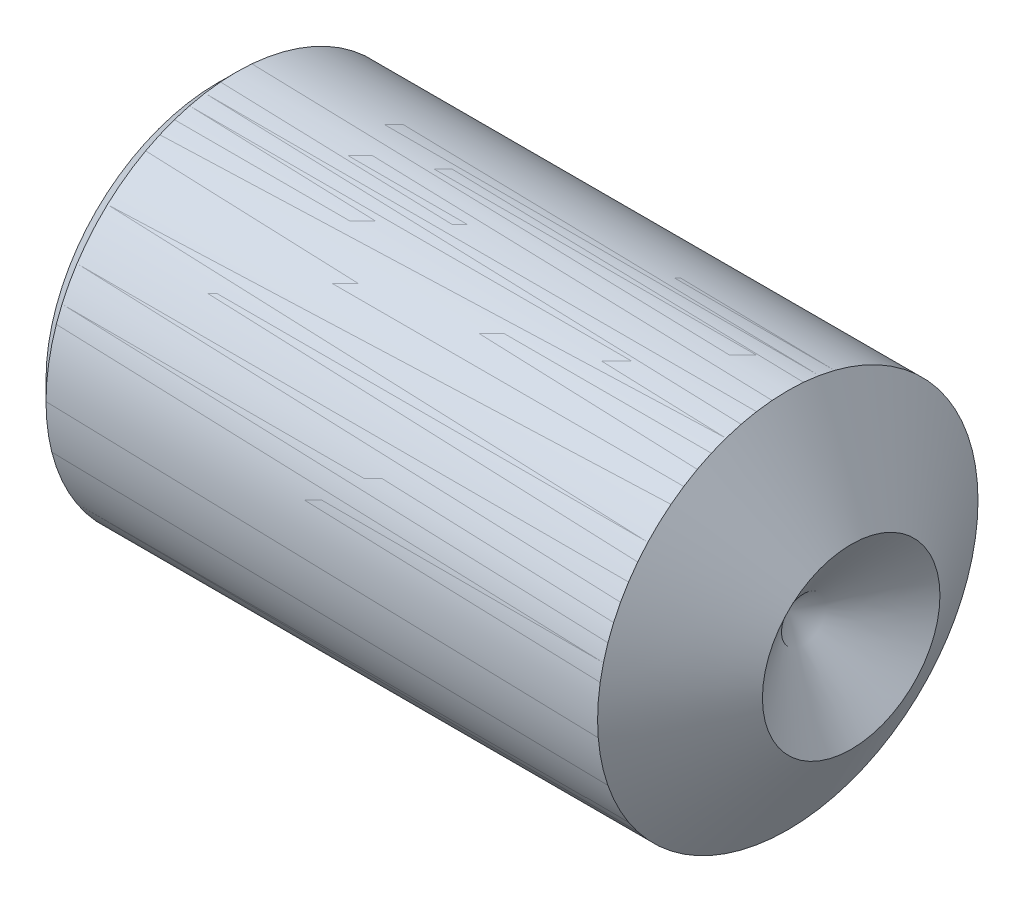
ISO-10303-21;
HEADER;
FILE_DESCRIPTION(('STEP AP214'),'2;1');
FILE_NAME('part.step','',(''),(''),'','','');
FILE_SCHEMA(('AUTOMOTIVE_DESIGN { 1 0 10303 214 1 1 1 1 }'));
ENDSEC;
DATA;
#1=APPLICATION_CONTEXT('core data for automotive mechanical design processes');
#2=APPLICATION_PROTOCOL_DEFINITION('international standard','automotive_design',2000,#1);
#3=PRODUCT_CONTEXT('',#1,'mechanical');
#4=PRODUCT('Part','Part','',(#3));
#5=PRODUCT_RELATED_PRODUCT_CATEGORY('part','',(#4));
#6=PRODUCT_DEFINITION_FORMATION('','',#4);
#7=PRODUCT_DEFINITION_CONTEXT('part definition',#1,'design');
#8=PRODUCT_DEFINITION('design','',#6,#7);
#9=PRODUCT_DEFINITION_SHAPE('','',#8);
#10=(LENGTH_UNIT() NAMED_UNIT(*) SI_UNIT(.MILLI.,.METRE.));
#11=(NAMED_UNIT(*) PLANE_ANGLE_UNIT() SI_UNIT($,.RADIAN.));
#12=(NAMED_UNIT(*) SI_UNIT($,.STERADIAN.) SOLID_ANGLE_UNIT());
#13=UNCERTAINTY_MEASURE_WITH_UNIT(LENGTH_MEASURE(1.E-05),#10,'distance_accuracy_value','');
#14=(GEOMETRIC_REPRESENTATION_CONTEXT(3) GLOBAL_UNCERTAINTY_ASSIGNED_CONTEXT((#13)) GLOBAL_UNIT_ASSIGNED_CONTEXT((#10,
#11,#12)) REPRESENTATION_CONTEXT('',''));
#15=CARTESIAN_POINT('',(0.,0.,0.));
#16=DIRECTION('',(0.,0.,1.));
#17=DIRECTION('',(1.,0.,0.));
#18=AXIS2_PLACEMENT_3D('',#15,#16,#17);
#19=CARTESIAN_POINT('',(-0.8125,0.3247595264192,-0.1875));
#20=DIRECTION('',(0.894427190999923,0.38729833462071,-0.223606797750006));
#21=DIRECTION('',(-0.397359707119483,0.91766293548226,0.));
#22=AXIS2_PLACEMENT_3D('',#19,#20,#21);
#23=PLANE('',#22);
#24=DIRECTION('',(0.397359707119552,-0.458831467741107,0.794719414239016));
#25=VECTOR('',#24,1.);
#26=CARTESIAN_POINT('',(-1.00000000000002,0.4330127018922,-0.749999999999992));
#27=LINE('',#26,#25);
#28=CARTESIAN_POINT('',(-1.,0.433012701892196,-0.749999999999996));
#29=VERTEX_POINT('',#28);
#30=CARTESIAN_POINT('',(-0.624999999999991,0.,0.));
#31=VERTEX_POINT('',#30);
#32=EDGE_CURVE('P0_E146',#29,#31,#27,.T.);
#33=ORIENTED_EDGE('',*,*,#32,.T.);
#34=DIRECTION('',(-0.397359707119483,0.91766293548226,0.));
#35=VECTOR('',#34,1.);
#36=CARTESIAN_POINT('',(-0.773026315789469,0.341852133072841,0.));
#37=LINE('',#36,#35);
#38=CARTESIAN_POINT('',(-0.999999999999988,0.866025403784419,0.));
#39=VERTEX_POINT('',#38);
#40=EDGE_CURVE('P0_E187',#31,#39,#37,.T.);
#41=ORIENTED_EDGE('',*,*,#40,.T.);
#42=DIRECTION('',(0.,0.500000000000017,0.866025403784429));
#43=VECTOR('',#42,1.);
#44=CARTESIAN_POINT('',(-1.,0.6495190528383,-0.375));
#45=LINE('',#44,#43);
#46=EDGE_CURVE('P0_E93',#39,#29,#45,.F.);
#47=ORIENTED_EDGE('',*,*,#46,.T.);
#48=EDGE_LOOP('',(#33,#41,#47));
#49=FACE_BOUND('',#48,.T.);
#50=ADVANCED_FACE('P0_F17',(#49),#23,.F.);
#51=CARTESIAN_POINT('',(-0.8125,0.,-0.375));
#52=DIRECTION('',(0.894427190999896,0.,-0.447213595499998));
#53=DIRECTION('',(-0.447213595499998,0.,-0.894427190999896));
#54=AXIS2_PLACEMENT_3D('',#51,#52,#53);
#55=PLANE('',#54);
#56=DIRECTION('',(0.397359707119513,0.458831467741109,0.794719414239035));
#57=VECTOR('',#56,1.);
#58=CARTESIAN_POINT('',(-0.99999999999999,-0.433012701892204,-0.750000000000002));
#59=LINE('',#58,#57);
#60=CARTESIAN_POINT('',(-0.999999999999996,-0.433012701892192,-0.749999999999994));
#61=VERTEX_POINT('',#60);
#62=EDGE_CURVE('P0_E148',#61,#31,#59,.T.);
#63=ORIENTED_EDGE('',*,*,#62,.T.);
#64=ORIENTED_EDGE('',*,*,#32,.F.);
#65=DIRECTION('',(0.,1.,0.));
#66=VECTOR('',#65,1.);
#67=CARTESIAN_POINT('',(-1.,0.,-0.75));
#68=LINE('',#67,#66);
#69=EDGE_CURVE('P0_E92',#29,#61,#68,.F.);
#70=ORIENTED_EDGE('',*,*,#69,.T.);
#71=EDGE_LOOP('',(#63,#64,#70));
#72=FACE_BOUND('',#71,.T.);
#73=ADVANCED_FACE('P0_F343',(#72),#55,.F.);
#74=CARTESIAN_POINT('',(-0.8125,-0.3247595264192,-0.1875));
#75=DIRECTION('',(0.894427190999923,-0.38729833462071,-0.223606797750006));
#76=DIRECTION('',(0.397359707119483,0.91766293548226,0.));
#77=AXIS2_PLACEMENT_3D('',#74,#75,#76);
#78=PLANE('',#77);
#79=DIRECTION('',(0.397359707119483,0.91766293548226,0.));
#80=VECTOR('',#79,1.);
#81=CARTESIAN_POINT('',(-0.773026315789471,-0.34185213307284,0.));
#82=LINE('',#81,#80);
#83=CARTESIAN_POINT('',(-0.99999999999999,-0.866025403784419,0.));
#84=VERTEX_POINT('',#83);
#85=EDGE_CURVE('P0_E157',#84,#31,#82,.T.);
#86=ORIENTED_EDGE('',*,*,#85,.T.);
#87=ORIENTED_EDGE('',*,*,#62,.F.);
#88=DIRECTION('',(0.,0.500000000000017,-0.866025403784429));
#89=VECTOR('',#88,1.);
#90=CARTESIAN_POINT('',(-1.,-0.6495190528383,-0.375));
#91=LINE('',#90,#89);
#92=EDGE_CURVE('P0_E160',#61,#84,#91,.F.);
#93=ORIENTED_EDGE('',*,*,#92,.T.);
#94=EDGE_LOOP('',(#86,#87,#93));
#95=FACE_BOUND('',#94,.T.);
#96=ADVANCED_FACE('P0_F335',(#95),#78,.F.);
#97=CARTESIAN_POINT('',(-0.8125,-0.3247595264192,0.1875));
#98=DIRECTION('',(0.894427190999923,-0.38729833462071,0.223606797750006));
#99=DIRECTION('',(0.397359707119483,0.91766293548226,0.));
#100=AXIS2_PLACEMENT_3D('',#97,#98,#99);
#101=PLANE('',#100);
#102=DIRECTION('',(0.397359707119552,0.458831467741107,-0.794719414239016));
#103=VECTOR('',#102,1.);
#104=CARTESIAN_POINT('',(-1.00000000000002,-0.4330127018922,0.749999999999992));
#105=LINE('',#104,#103);
#106=CARTESIAN_POINT('',(-1.,-0.433012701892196,0.749999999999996));
#107=VERTEX_POINT('',#106);
#108=EDGE_CURVE('P0_E167',#107,#31,#105,.T.);
#109=ORIENTED_EDGE('',*,*,#108,.T.);
#110=ORIENTED_EDGE('',*,*,#85,.F.);
#111=DIRECTION('',(0.,-0.500000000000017,-0.866025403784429));
#112=VECTOR('',#111,1.);
#113=CARTESIAN_POINT('',(-1.,-0.6495190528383,0.375));
#114=LINE('',#113,#112);
#115=EDGE_CURVE('P0_E170',#84,#107,#114,.F.);
#116=ORIENTED_EDGE('',*,*,#115,.T.);
#117=EDGE_LOOP('',(#109,#110,#116));
#118=FACE_BOUND('',#117,.T.);
#119=ADVANCED_FACE('P0_F327',(#118),#101,.F.);
#120=CARTESIAN_POINT('',(-0.8125,0.,0.375));
#121=DIRECTION('',(0.894427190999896,0.,0.447213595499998));
#122=DIRECTION('',(0.447213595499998,0.,-0.894427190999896));
#123=AXIS2_PLACEMENT_3D('',#120,#121,#122);
#124=PLANE('',#123);
#125=DIRECTION('',(0.397359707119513,-0.458831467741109,-0.794719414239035));
#126=VECTOR('',#125,1.);
#127=CARTESIAN_POINT('',(-0.99999999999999,0.433012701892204,0.750000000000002));
#128=LINE('',#127,#126);
#129=CARTESIAN_POINT('',(-0.999999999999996,0.433012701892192,0.749999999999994));
#130=VERTEX_POINT('',#129);
#131=EDGE_CURVE('P0_E177',#130,#31,#128,.T.);
#132=ORIENTED_EDGE('',*,*,#131,.T.);
#133=ORIENTED_EDGE('',*,*,#108,.F.);
#134=DIRECTION('',(0.,1.,0.));
#135=VECTOR('',#134,1.);
#136=CARTESIAN_POINT('',(-1.,0.,0.75));
#137=LINE('',#136,#135);
#138=EDGE_CURVE('P0_E180',#107,#130,#137,.T.);
#139=ORIENTED_EDGE('',*,*,#138,.T.);
#140=EDGE_LOOP('',(#132,#133,#139));
#141=FACE_BOUND('',#140,.T.);
#142=ADVANCED_FACE('P0_F319',(#141),#124,.F.);
#143=CARTESIAN_POINT('',(-0.8125,0.3247595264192,0.1875));
#144=DIRECTION('',(0.894427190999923,0.38729833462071,0.223606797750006));
#145=DIRECTION('',(-0.397359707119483,0.91766293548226,0.));
#146=AXIS2_PLACEMENT_3D('',#143,#144,#145);
#147=PLANE('',#146);
#148=ORIENTED_EDGE('',*,*,#40,.F.);
#149=ORIENTED_EDGE('',*,*,#131,.F.);
#150=DIRECTION('',(0.,-0.500000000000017,0.866025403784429));
#151=VECTOR('',#150,1.);
#152=CARTESIAN_POINT('',(-1.,0.6495190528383,0.375));
#153=LINE('',#152,#151);
#154=EDGE_CURVE('P0_E193',#130,#39,#153,.F.);
#155=ORIENTED_EDGE('',*,*,#154,.T.);
#156=EDGE_LOOP('',(#148,#149,#155));
#157=FACE_BOUND('',#156,.T.);
#158=ADVANCED_FACE('P0_F313',(#157),#147,.F.);
#159=CARTESIAN_POINT('',(-1.75,0.6495190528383,-0.375));
#160=DIRECTION('',(0.,0.866025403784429,-0.500000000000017));
#161=DIRECTION('',(0.,0.500000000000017,0.866025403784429));
#162=AXIS2_PLACEMENT_3D('',#159,#160,#161);
#163=PLANE('',#162);
#164=ORIENTED_EDGE('',*,*,#46,.F.);
#165=DIRECTION('',(1.,0.,0.));
#166=VECTOR('',#165,1.);
#167=CARTESIAN_POINT('',(-1.75,0.866025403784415,0.));
#168=LINE('',#167,#166);
#169=CARTESIAN_POINT('',(-2.45102540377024,0.866025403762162,0.));
#170=VERTEX_POINT('',#169);
#171=EDGE_CURVE('P0_E86',#39,#170,#168,.F.);
#172=ORIENTED_EDGE('',*,*,#171,.T.);
#173=CARTESIAN_POINT('',(-2.45102540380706,0.866025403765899,-2.2156686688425E-11));
#174=CARTESIAN_POINT('',(-2.43615687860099,0.851142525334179,-0.0257779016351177));
#175=CARTESIAN_POINT('',(-2.42216167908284,0.836010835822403,-0.0519867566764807));
#176=CARTESIAN_POINT('',(-2.39653706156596,0.805155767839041,-0.105429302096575));
#177=CARTESIAN_POINT('',(-2.38492189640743,0.789429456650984,-0.132668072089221));
#178=CARTESIAN_POINT('',(-2.3650251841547,0.757718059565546,-0.18759382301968));
#179=CARTESIAN_POINT('',(-2.35669363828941,0.741741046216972,-0.2152668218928));
#180=CARTESIAN_POINT('',(-2.34385676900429,0.709435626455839,-0.271221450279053));
#181=CARTESIAN_POINT('',(-2.33934186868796,0.693108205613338,-0.29950137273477));
#182=CARTESIAN_POINT('',(-2.3352695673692,0.664965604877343,-0.348245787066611));
#183=CARTESIAN_POINT('',(-2.33466782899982,0.653186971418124,-0.368646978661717));
#184=CARTESIAN_POINT('',(-2.33568198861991,0.629652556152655,-0.409409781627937));
#185=CARTESIAN_POINT('',(-2.337298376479,0.617896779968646,-0.429771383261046));
#186=CARTESIAN_POINT('',(-2.34536789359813,0.582797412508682,-0.490565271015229));
#187=CARTESIAN_POINT('',(-2.35504228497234,0.55962854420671,-0.530694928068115));
#188=CARTESIAN_POINT('',(-2.37837866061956,0.518981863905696,-0.601097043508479));
#189=CARTESIAN_POINT('',(-2.39081313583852,0.501312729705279,-0.631700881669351));
#190=CARTESIAN_POINT('',(-2.41882134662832,0.466665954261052,-0.69171085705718));
#191=CARTESIAN_POINT('',(-2.4343848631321,0.449686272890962,-0.721120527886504));
#192=CARTESIAN_POINT('',(-2.45102536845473,0.433012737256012,-0.749999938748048));
#193=B_SPLINE_CURVE_WITH_KNOTS('',3,(#173,#174,#175,#176,#177,#178,#179,#180,#181,#182,#183,
#184,#185,#186,#187,#188,#189,#190,#191,#192),.UNSPECIFIED.,.F.,.F.,(4,2,2,2,2,2,2,2,2,4),(0.,
0.0998872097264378,0.200356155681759,0.299229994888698,0.397854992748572,0.468447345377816,
0.539055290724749,0.680311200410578,0.792547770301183,0.904423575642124),.UNSPECIFIED.);
#194=CARTESIAN_POINT('',(-2.45102538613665,0.433012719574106,-0.749999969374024));
#195=VERTEX_POINT('',#194);
#196=EDGE_CURVE('P0_E20',#170,#195,#193,.T.);
#197=ORIENTED_EDGE('',*,*,#196,.T.);
#198=DIRECTION('',(-1.,0.,0.));
#199=VECTOR('',#198,1.);
#200=CARTESIAN_POINT('',(-1.75,0.4330127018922,-0.75));
#201=LINE('',#200,#199);
#202=EDGE_CURVE('P0_E83',#195,#29,#201,.F.);
#203=ORIENTED_EDGE('',*,*,#202,.T.);
#204=EDGE_LOOP('',(#164,#172,#197,#203));
#205=FACE_BOUND('',#204,.T.);
#206=ADVANCED_FACE('P0_F82',(#205),#163,.F.);
#207=CARTESIAN_POINT('',(-1.75,0.,-0.75));
#208=DIRECTION('',(0.,0.,-1.));
#209=DIRECTION('',(-1.,0.,0.));
#210=AXIS2_PLACEMENT_3D('',#207,#208,#209);
#211=PLANE('',#210);
#212=ORIENTED_EDGE('',*,*,#69,.F.);
#213=ORIENTED_EDGE('',*,*,#202,.F.);
#214=CARTESIAN_POINT('',(-2.45102542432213,0.433012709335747,-0.749999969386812));
#215=CARTESIAN_POINT('',(-2.43615689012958,0.403246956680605,-0.749999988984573));
#216=CARTESIAN_POINT('',(-2.4221616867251,0.372983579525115,-0.74999999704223));
#217=CARTESIAN_POINT('',(-2.39653706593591,0.311273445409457,-0.750000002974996));
#218=CARTESIAN_POINT('',(-2.38492190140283,0.279820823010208,-0.750000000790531));
#219=CARTESIAN_POINT('',(-2.36502518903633,0.21639802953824,-0.74999999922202));
#220=CARTESIAN_POINT('',(-2.35669364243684,0.184444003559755,-0.749999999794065));
#221=CARTESIAN_POINT('',(-2.34385677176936,0.119833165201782,-0.750000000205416));
#222=CARTESIAN_POINT('',(-2.3393418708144,0.0871783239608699,-0.750000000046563));
#223=CARTESIAN_POINT('',(-2.33526956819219,0.0308931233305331,-0.749999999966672));
#224=CARTESIAN_POINT('',(-2.33466782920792,0.00733585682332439,-0.749999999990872));
#225=CARTESIAN_POINT('',(-2.33568198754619,-0.0397329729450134,-0.75000000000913));
#226=CARTESIAN_POINT('',(-2.33729837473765,-0.0632445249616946,-0.75000000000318));
#227=CARTESIAN_POINT('',(-2.3453678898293,-0.133443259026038,-0.749999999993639));
#228=CARTESIAN_POINT('',(-2.35504227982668,-0.179780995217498,-0.749999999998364));
#229=CARTESIAN_POINT('',(-2.37837865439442,-0.261074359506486,-0.7500000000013));
#230=CARTESIAN_POINT('',(-2.39081313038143,-0.296412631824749,-0.750000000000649));
#231=CARTESIAN_POINT('',(-2.41882134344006,-0.365706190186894,-0.749999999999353));
#232=CARTESIAN_POINT('',(-2.43438486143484,-0.399665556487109,-0.749999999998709));
#233=CARTESIAN_POINT('',(-2.451025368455,-0.433012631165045,-0.75));
#234=B_SPLINE_CURVE_WITH_KNOTS('',3,(#214,#215,#216,#217,#218,#219,#220,#221,#222,#223,#224,
#225,#226,#227,#228,#229,#230,#231,#232,#233),.UNSPECIFIED.,.F.,.F.,(4,2,2,2,2,2,2,2,2,4),(0.,
0.099887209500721,0.20035615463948,0.299229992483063,0.39785498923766,0.468447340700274,
0.539055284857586,0.68031119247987,0.792547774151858,0.904423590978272),.UNSPECIFIED.);
#235=CARTESIAN_POINT('',(-2.45102538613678,-0.433012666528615,-0.749999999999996));
#236=VERTEX_POINT('',#235);
#237=EDGE_CURVE('P0_E75',#195,#236,#234,.T.);
#238=ORIENTED_EDGE('',*,*,#237,.T.);
#239=DIRECTION('',(1.,0.,0.));
#240=VECTOR('',#239,1.);
#241=CARTESIAN_POINT('',(-1.75,-0.433012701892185,-0.749999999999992));
#242=LINE('',#241,#240);
#243=EDGE_CURVE('P0_E152',#236,#61,#242,.T.);
#244=ORIENTED_EDGE('',*,*,#243,.T.);
#245=EDGE_LOOP('',(#212,#213,#238,#244));
#246=FACE_BOUND('',#245,.T.);
#247=ADVANCED_FACE('P0_F91',(#246),#211,.F.);
#248=CARTESIAN_POINT('',(-1.75,-0.6495190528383,-0.375));
#249=DIRECTION('',(0.,-0.866025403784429,-0.500000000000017));
#250=DIRECTION('',(0.,0.500000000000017,-0.866025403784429));
#251=AXIS2_PLACEMENT_3D('',#248,#249,#250);
#252=PLANE('',#251);
#253=ORIENTED_EDGE('',*,*,#92,.F.);
#254=ORIENTED_EDGE('',*,*,#243,.F.);
#255=CARTESIAN_POINT('',(-2.45102542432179,-0.433012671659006,-0.749999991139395));
#256=CARTESIAN_POINT('',(-2.43615689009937,-0.447895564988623,-0.724222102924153));
#257=CARTESIAN_POINT('',(-2.42216168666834,-0.463027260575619,-0.698013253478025));
#258=CARTESIAN_POINT('',(-2.39653706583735,-0.493882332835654,-0.644570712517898));
#259=CARTESIAN_POINT('',(-2.38492190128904,-0.509608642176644,-0.617331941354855));
#260=CARTESIAN_POINT('',(-2.36502518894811,-0.541320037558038,-0.562406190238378));
#261=CARTESIAN_POINT('',(-2.35669364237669,-0.557297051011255,-0.534733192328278));
#262=CARTESIAN_POINT('',(-2.3438567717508,-0.589602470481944,-0.478778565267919));
#263=CARTESIAN_POINT('',(-2.33934187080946,-0.605929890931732,-0.450498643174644));
#264=CARTESIAN_POINT('',(-2.3352695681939,-0.634072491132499,-0.401754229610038));
#265=CARTESIAN_POINT('',(-2.33466782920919,-0.645851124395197,-0.381353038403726));
#266=CARTESIAN_POINT('',(-2.33568198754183,-0.669385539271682,-0.340590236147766));
#267=CARTESIAN_POINT('',(-2.33729837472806,-0.68114131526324,-0.32022863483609));
#268=CARTESIAN_POINT('',(-2.34536788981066,-0.716240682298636,-0.259434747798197));
#269=CARTESIAN_POINT('',(-2.35504227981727,-0.739409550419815,-0.219305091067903));
#270=CARTESIAN_POINT('',(-2.3783786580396,-0.780056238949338,-0.148902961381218));
#271=CARTESIAN_POINT('',(-2.390813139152,-0.797725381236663,-0.118299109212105));
#272=CARTESIAN_POINT('',(-2.41882136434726,-0.832372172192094,-0.0582891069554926));
#273=CARTESIAN_POINT('',(-2.43438488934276,-0.849351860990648,-0.0288794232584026));
#274=CARTESIAN_POINT('',(-2.45102540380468,-0.866025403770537,-2.40451589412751E-11));
#275=B_SPLINE_CURVE_WITH_KNOTS('',3,(#255,#256,#257,#258,#259,#260,#261,#262,#263,#264,#265,
#266,#267,#268,#269,#270,#271,#272,#273,#274),.UNSPECIFIED.,.F.,.F.,(4,2,2,2,2,2,2,2,2,4),(0.,
0.0998872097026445,0.200356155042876,0.299229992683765,0.397854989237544,0.468447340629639,
0.539055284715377,0.680311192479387,0.792547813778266,0.904423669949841),.UNSPECIFIED.);
#276=CARTESIAN_POINT('',(-2.45102540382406,-0.866025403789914,-1.18475610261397E-11));
#277=VERTEX_POINT('',#276);
#278=EDGE_CURVE('P0_E99',#236,#277,#275,.T.);
#279=ORIENTED_EDGE('',*,*,#278,.T.);
#280=DIRECTION('',(1.,0.,0.));
#281=VECTOR('',#280,1.);
#282=CARTESIAN_POINT('',(-1.75,-0.866025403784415,0.));
#283=LINE('',#282,#281);
#284=EDGE_CURVE('P0_E162',#277,#84,#283,.T.);
#285=ORIENTED_EDGE('',*,*,#284,.T.);
#286=EDGE_LOOP('',(#253,#254,#279,#285));
#287=FACE_BOUND('',#286,.T.);
#288=ADVANCED_FACE('P0_F294',(#287),#252,.F.);
#289=CARTESIAN_POINT('',(-1.75,-0.6495190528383,0.375));
#290=DIRECTION('',(0.,-0.866025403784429,0.500000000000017));
#291=DIRECTION('',(0.,-0.500000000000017,-0.866025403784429));
#292=AXIS2_PLACEMENT_3D('',#289,#290,#291);
#293=PLANE('',#292);
#294=ORIENTED_EDGE('',*,*,#115,.F.);
#295=ORIENTED_EDGE('',*,*,#284,.F.);
#296=CARTESIAN_POINT('',(-2.45102540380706,-0.866025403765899,2.2158524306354E-11));
#297=CARTESIAN_POINT('',(-2.43615687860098,-0.85114252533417,0.0257779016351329));
#298=CARTESIAN_POINT('',(-2.42216167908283,-0.836010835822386,0.0519867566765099));
#299=CARTESIAN_POINT('',(-2.39653706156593,-0.805155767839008,0.105429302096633));
#300=CARTESIAN_POINT('',(-2.3849218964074,-0.789429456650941,0.132668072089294));
#301=CARTESIAN_POINT('',(-2.36502518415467,-0.757718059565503,0.187593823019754));
#302=CARTESIAN_POINT('',(-2.35669363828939,-0.741741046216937,0.215266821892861));
#303=CARTESIAN_POINT('',(-2.34385676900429,-0.709435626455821,0.271221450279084));
#304=CARTESIAN_POINT('',(-2.33934186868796,-0.693108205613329,0.299501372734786));
#305=CARTESIAN_POINT('',(-2.3352695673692,-0.664965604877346,0.348245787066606));
#306=CARTESIAN_POINT('',(-2.33466782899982,-0.65318697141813,0.368646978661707));
#307=CARTESIAN_POINT('',(-2.3356819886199,-0.629652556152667,0.409409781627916));
#308=CARTESIAN_POINT('',(-2.337298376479,-0.617896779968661,0.42977138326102));
#309=CARTESIAN_POINT('',(-2.34536789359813,-0.582797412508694,0.490565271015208));
#310=CARTESIAN_POINT('',(-2.35504228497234,-0.559628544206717,0.530694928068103));
#311=CARTESIAN_POINT('',(-2.37837866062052,-0.518981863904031,0.601097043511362));
#312=CARTESIAN_POINT('',(-2.39081313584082,-0.501312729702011,0.631700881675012));
#313=CARTESIAN_POINT('',(-2.41882134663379,-0.466665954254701,0.69171085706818));
#314=CARTESIAN_POINT('',(-2.4343848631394,-0.449686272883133,0.721120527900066));
#315=CARTESIAN_POINT('',(-2.45102536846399,-0.433012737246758,0.749999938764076));
#316=B_SPLINE_CURVE_WITH_KNOTS('',3,(#296,#297,#298,#299,#300,#301,#302,#303,#304,#305,#306,
#307,#308,#309,#310,#311,#312,#313,#314,#315),.UNSPECIFIED.,.F.,.F.,(4,2,2,2,2,2,2,2,2,4),(0.,
0.0998872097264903,0.200356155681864,0.29922999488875,0.39785499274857,0.468447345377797,
0.539055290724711,0.680311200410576,0.792547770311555,0.904423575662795),.UNSPECIFIED.);
#317=CARTESIAN_POINT('',(-2.45102538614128,-0.433012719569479,0.749999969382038));
#318=VERTEX_POINT('',#317);
#319=EDGE_CURVE('P0_E100',#277,#318,#316,.T.);
#320=ORIENTED_EDGE('',*,*,#319,.T.);
#321=DIRECTION('',(1.,0.,0.));
#322=VECTOR('',#321,1.);
#323=CARTESIAN_POINT('',(-1.75,-0.4330127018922,0.75));
#324=LINE('',#323,#322);
#325=EDGE_CURVE('P0_E172',#318,#107,#324,.T.);
#326=ORIENTED_EDGE('',*,*,#325,.T.);
#327=EDGE_LOOP('',(#294,#295,#320,#326));
#328=FACE_BOUND('',#327,.T.);
#329=ADVANCED_FACE('P0_F287',(#328),#293,.F.);
#330=CARTESIAN_POINT('',(-1.75,0.,0.75));
#331=DIRECTION('',(0.,0.,1.));
#332=DIRECTION('',(1.,0.,0.));
#333=AXIS2_PLACEMENT_3D('',#330,#331,#332);
#334=PLANE('',#333);
#335=ORIENTED_EDGE('',*,*,#138,.F.);
#336=ORIENTED_EDGE('',*,*,#325,.F.);
#337=CARTESIAN_POINT('',(-2.45102542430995,-0.433012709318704,0.749999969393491));
#338=CARTESIAN_POINT('',(-2.43615689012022,-0.403246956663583,0.749999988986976));
#339=CARTESIAN_POINT('',(-2.42216168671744,-0.372983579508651,0.749999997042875));
#340=CARTESIAN_POINT('',(-2.39653706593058,-0.311273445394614,0.750000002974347));
#341=CARTESIAN_POINT('',(-2.38492190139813,-0.27982082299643,0.750000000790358));
#342=CARTESIAN_POINT('',(-2.365025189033,-0.216398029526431,0.74999999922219));
#343=CARTESIAN_POINT('',(-2.35669364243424,-0.184444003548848,0.74999999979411));
#344=CARTESIAN_POINT('',(-2.343856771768,-0.119833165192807,0.750000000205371));
#345=CARTESIAN_POINT('',(-2.33934187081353,-0.0871783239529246,0.750000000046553));
#346=CARTESIAN_POINT('',(-2.3352695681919,-0.0308931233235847,0.749999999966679));
#347=CARTESIAN_POINT('',(-2.33466782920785,-0.00733585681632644,0.749999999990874));
#348=CARTESIAN_POINT('',(-2.33568198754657,0.0397329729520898,0.750000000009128));
#349=CARTESIAN_POINT('',(-2.33729837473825,0.0632445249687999,0.750000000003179));
#350=CARTESIAN_POINT('',(-2.34536788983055,0.133443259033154,0.74999999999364));
#351=CARTESIAN_POINT('',(-2.35504227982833,0.179780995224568,0.749999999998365));
#352=CARTESIAN_POINT('',(-2.37837865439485,0.261074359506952,0.750000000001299));
#353=CARTESIAN_POINT('',(-2.3908131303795,0.2964126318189,0.750000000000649));
#354=CARTESIAN_POINT('',(-2.41882134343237,0.365706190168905,0.749999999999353));
#355=CARTESIAN_POINT('',(-2.43438486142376,0.399665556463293,0.749999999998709));
#356=CARTESIAN_POINT('',(-2.45102536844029,0.433012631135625,0.75));
#357=B_SPLINE_CURVE_WITH_KNOTS('',3,(#337,#338,#339,#340,#341,#342,#343,#344,#345,#346,#347,
#348,#349,#350,#351,#352,#353,#354,#355,#356),.UNSPECIFIED.,.F.,.F.,(4,2,2,2,2,2,2,2,2,4),(0.,
0.0998872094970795,0.200356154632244,0.299229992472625,0.397854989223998,0.468447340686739,
0.539055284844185,0.68031119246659,0.792547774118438,0.904423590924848),.UNSPECIFIED.);
#358=CARTESIAN_POINT('',(-2.45102538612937,0.433012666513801,0.749999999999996));
#359=VERTEX_POINT('',#358);
#360=EDGE_CURVE('P0_E124',#318,#359,#357,.T.);
#361=ORIENTED_EDGE('',*,*,#360,.T.);
#362=DIRECTION('',(1.,0.,0.));
#363=VECTOR('',#362,1.);
#364=CARTESIAN_POINT('',(-1.75,0.433012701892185,0.749999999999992));
#365=LINE('',#364,#363);
#366=EDGE_CURVE('P0_E182',#359,#130,#365,.T.);
#367=ORIENTED_EDGE('',*,*,#366,.T.);
#368=EDGE_LOOP('',(#335,#336,#361,#367));
#369=FACE_BOUND('',#368,.T.);
#370=ADVANCED_FACE('P0_F280',(#369),#334,.F.);
#371=CARTESIAN_POINT('',(-1.75,0.6495190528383,0.375));
#372=DIRECTION('',(0.,0.866025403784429,0.500000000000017));
#373=DIRECTION('',(0.,-0.500000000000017,0.866025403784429));
#374=AXIS2_PLACEMENT_3D('',#371,#372,#373);
#375=PLANE('',#374);
#376=ORIENTED_EDGE('',*,*,#154,.F.);
#377=ORIENTED_EDGE('',*,*,#366,.F.);
#378=CARTESIAN_POINT('',(-2.45102542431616,0.433012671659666,0.749999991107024));
#379=CARTESIAN_POINT('',(-2.43615689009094,0.447895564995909,0.724222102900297));
#380=CARTESIAN_POINT('',(-2.42216168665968,0.463027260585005,0.698013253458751));
#381=CARTESIAN_POINT('',(-2.39653706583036,0.49388233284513,0.644570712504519));
#382=CARTESIAN_POINT('',(-2.38492190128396,0.509608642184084,0.617331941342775));
#383=CARTESIAN_POINT('',(-2.36502518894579,0.541320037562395,0.562406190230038));
#384=CARTESIAN_POINT('',(-2.35669364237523,0.557297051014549,0.534733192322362));
#385=CARTESIAN_POINT('',(-2.34385677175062,0.589602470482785,0.478778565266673));
#386=CARTESIAN_POINT('',(-2.3393418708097,0.605929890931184,0.45049864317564));
#387=CARTESIAN_POINT('',(-2.33526956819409,0.63407249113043,0.401754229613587));
#388=CARTESIAN_POINT('',(-2.33466782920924,0.645851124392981,0.381353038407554));
#389=CARTESIAN_POINT('',(-2.33568198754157,0.669385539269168,0.340590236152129));
#390=CARTESIAN_POINT('',(-2.33729837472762,0.681141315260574,0.320228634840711));
#391=CARTESIAN_POINT('',(-2.34536788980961,0.716240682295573,0.259434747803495));
#392=CARTESIAN_POINT('',(-2.35504227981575,0.739409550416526,0.219305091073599));
#393=CARTESIAN_POINT('',(-2.37837865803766,0.780056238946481,0.148902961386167));
#394=CARTESIAN_POINT('',(-2.39081313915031,0.797725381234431,0.118299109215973));
#395=CARTESIAN_POINT('',(-2.41882136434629,0.832372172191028,0.0582891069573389));
#396=CARTESIAN_POINT('',(-2.43438488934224,0.849351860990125,0.0288794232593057));
#397=CARTESIAN_POINT('',(-2.45102540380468,0.866025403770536,2.40466742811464E-11));
#398=B_SPLINE_CURVE_WITH_KNOTS('',3,(#378,#379,#380,#381,#382,#383,#384,#385,#386,#387,#388,
#389,#390,#391,#392,#393,#394,#395,#396,#397),.UNSPECIFIED.,.F.,.F.,(4,2,2,2,2,2,2,2,2,4),(0.,
0.0998872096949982,0.200356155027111,0.299229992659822,0.39785498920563,0.468447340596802,
0.53905528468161,0.680311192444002,0.792547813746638,0.904423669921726),.UNSPECIFIED.);
#399=EDGE_CURVE('P0_E132',#359,#170,#398,.T.);
#400=ORIENTED_EDGE('',*,*,#399,.T.);
#401=ORIENTED_EDGE('',*,*,#171,.F.);
#402=EDGE_LOOP('',(#376,#377,#400,#401));
#403=FACE_BOUND('',#402,.T.);
#404=ADVANCED_FACE('P0_F117',(#403),#375,.F.);
#405=CARTESIAN_POINT('',(-2.49999999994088,0.,0.));
#406=DIRECTION('',(-1.,0.,0.));
#407=DIRECTION('',(0.,0.,1.));
#408=AXIS2_PLACEMENT_3D('',#405,#406,#407);
#409=CONICAL_SURFACE('',#408,0.91499999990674,0.785398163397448);
#410=ORIENTED_EDGE('',*,*,#319,.F.);
#411=ORIENTED_EDGE('',*,*,#278,.F.);
#412=ORIENTED_EDGE('',*,*,#237,.F.);
#413=ORIENTED_EDGE('',*,*,#196,.F.);
#414=ORIENTED_EDGE('',*,*,#399,.F.);
#415=ORIENTED_EDGE('',*,*,#360,.F.);
#416=EDGE_LOOP('',(#410,#411,#412,#413,#414,#415));
#417=FACE_BOUND('',#416,.T.);
#418=CARTESIAN_POINT('',(-2.50000000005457,0.,0.));
#419=DIRECTION('',(-1.,0.,0.));
#420=DIRECTION('',(0.,0.,1.));
#421=AXIS2_PLACEMENT_3D('',#418,#419,#420);
#422=CIRCLE('',#421,0.915000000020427);
#423=CARTESIAN_POINT('',(-2.50000000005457,0.,0.915000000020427));
#424=VERTEX_POINT('',#423);
#425=EDGE_CURVE('P0_E137',#424,#424,#422,.T.);
#426=ORIENTED_EDGE('',*,*,#425,.T.);
#427=EDGE_LOOP('',(#426));
#428=FACE_BOUND('',#427,.T.);
#429=ADVANCED_FACE('P0_F97',(#417,#428),#409,.F.);
#430=CARTESIAN_POINT('',(-2.5,0.,0.));
#431=DIRECTION('',(1.,0.,0.));
#432=DIRECTION('',(0.,0.,-1.));
#433=AXIS2_PLACEMENT_3D('',#430,#431,#432);
#434=PLANE('',#433);
#435=ORIENTED_EDGE('',*,*,#425,.F.);
#436=EDGE_LOOP('',(#435));
#437=FACE_BOUND('',#436,.T.);
#438=CARTESIAN_POINT('',(-2.49999999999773,0.,0.));
#439=DIRECTION('',(1.,0.,0.));
#440=DIRECTION('',(0.,0.,-1.));
#441=AXIS2_PLACEMENT_3D('',#438,#439,#440);
#442=CIRCLE('',#441,1.35000000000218);
#443=CARTESIAN_POINT('',(-2.49999999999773,0.,-1.35000000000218));
#444=VERTEX_POINT('',#443);
#445=EDGE_CURVE('P0_E140',#444,#444,#442,.T.);
#446=ORIENTED_EDGE('',*,*,#445,.F.);
#447=EDGE_LOOP('',(#446));
#448=FACE_BOUND('',#447,.T.);
#449=ADVANCED_FACE('P0_F116',(#437,#448),#434,.F.);
#450=CARTESIAN_POINT('',(2.49999999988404,0.,0.));
#451=DIRECTION('',(1.,0.,0.));
#452=DIRECTION('',(0.,0.,-1.));
#453=AXIS2_PLACEMENT_3D('',#450,#451,#452);
#454=CONICAL_SURFACE('',#453,0.699999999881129,0.950546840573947);
#455=CARTESIAN_POINT('',(1.99999999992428,1.13686837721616E-10,0.));
#456=VERTEX_POINT('',#455);
#457=VERTEX_LOOP('',#456);
#458=FACE_BOUND('',#457,.T.);
#459=CARTESIAN_POINT('',(2.49999999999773,0.,0.));
#460=DIRECTION('',(-1.,0.,0.));
#461=DIRECTION('',(0.,1.,0.));
#462=AXIS2_PLACEMENT_3D('',#459,#460,#461);
#463=CIRCLE('',#462,0.699999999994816);
#464=CARTESIAN_POINT('',(2.49999999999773,0.699999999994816,0.));
#465=VERTEX_POINT('',#464);
#466=EDGE_CURVE('P0_E143',#465,#465,#463,.T.);
#467=ORIENTED_EDGE('',*,*,#466,.F.);
#468=EDGE_LOOP('',(#467));
#469=FACE_BOUND('',#468,.T.);
#470=ADVANCED_FACE('P0_F227',(#458,#469),#454,.F.);
#471=CARTESIAN_POINT('',(-2.35000000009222,0.,0.));
#472=DIRECTION('',(1.,0.,0.));
#473=DIRECTION('',(0.,0.,-1.));
#474=AXIS2_PLACEMENT_3D('',#471,#472,#473);
#475=CONICAL_SURFACE('',#474,1.49999999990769,0.785398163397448);
#476=CARTESIAN_POINT('',(-2.35,0.,0.));
#477=DIRECTION('',(1.,0.,0.));
#478=DIRECTION('',(0.,0.,-1.));
#479=AXIS2_PLACEMENT_3D('',#476,#477,#478);
#480=CIRCLE('',#479,1.5);
#481=CARTESIAN_POINT('',(-2.35,0.,-1.5));
#482=VERTEX_POINT('',#481);
#483=EDGE_CURVE('P0_E31',#482,#482,#480,.T.);
#484=ORIENTED_EDGE('',*,*,#483,.F.);
#485=EDGE_LOOP('',(#484));
#486=FACE_BOUND('',#485,.T.);
#487=ORIENTED_EDGE('',*,*,#445,.T.);
#488=EDGE_LOOP('',(#487));
#489=FACE_BOUND('',#488,.T.);
#490=ADVANCED_FACE('P0_F229',(#486,#489),#475,.T.);
#491=CARTESIAN_POINT('',(2.00000000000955,0.,0.));
#492=DIRECTION('',(-1.,0.,0.));
#493=DIRECTION('',(0.,0.,1.));
#494=AXIS2_PLACEMENT_3D('',#491,#492,#493);
#495=CONICAL_SURFACE('',#494,1.50000000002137,1.01219701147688);
#496=ORIENTED_EDGE('',*,*,#466,.T.);
#497=EDGE_LOOP('',(#496));
#498=FACE_BOUND('',#497,.T.);
#499=CARTESIAN_POINT('',(2.,0.,0.));
#500=DIRECTION('',(1.,0.,0.));
#501=DIRECTION('',(0.,0.,-1.));
#502=AXIS2_PLACEMENT_3D('',#499,#500,#501);
#503=CIRCLE('',#502,1.5);
#504=CARTESIAN_POINT('',(2.,0.,-1.5));
#505=VERTEX_POINT('',#504);
#506=EDGE_CURVE('P0_E11',#505,#505,#503,.F.);
#507=ORIENTED_EDGE('',*,*,#506,.F.);
#508=EDGE_LOOP('',(#507));
#509=FACE_BOUND('',#508,.T.);
#510=ADVANCED_FACE('P0_F224',(#498,#509),#495,.T.);
#511=CARTESIAN_POINT('',(-2.75,0.,0.));
#512=DIRECTION('',(1.,0.,0.));
#513=DIRECTION('',(0.,0.,-1.));
#514=AXIS2_PLACEMENT_3D('',#511,#512,#513);
#515=CYLINDRICAL_SURFACE('',#514,1.5);
#516=ORIENTED_EDGE('',*,*,#506,.T.);
#517=EDGE_LOOP('',(#516));
#518=FACE_BOUND('',#517,.T.);
#519=ORIENTED_EDGE('',*,*,#483,.T.);
#520=EDGE_LOOP('',(#519));
#521=FACE_BOUND('',#520,.T.);
#522=ADVANCED_FACE('P0_F238',(#518,#521),#515,.T.);
#523=CLOSED_SHELL('',(#50,#73,#96,#119,#142,#158,#206,#247,#288,#329,#370,#404,#429,#449,#470,
#490,#510,#522));
#524=MANIFOLD_SOLID_BREP('P0_B1',#523);
#525=CARTESIAN_POINT('',(-3.,0.,0.));
#526=DIRECTION('',(1.,0.,0.));
#527=DIRECTION('',(0.,0.,-1.));
#528=AXIS2_PLACEMENT_3D('',#525,#526,#527);
#529=CYLINDRICAL_SURFACE('',#528,1.5);
#530=CARTESIAN_POINT('',(2.,0.,0.));
#531=DIRECTION('',(1.,0.,0.));
#532=DIRECTION('',(0.,0.,-1.));
#533=AXIS2_PLACEMENT_3D('',#530,#531,#532);
#534=CIRCLE('',#533,1.5);
#535=CARTESIAN_POINT('',(2.,0.,-1.5));
#536=VERTEX_POINT('',#535);
#537=EDGE_CURVE('P1_E16',#536,#536,#534,.F.);
#538=ORIENTED_EDGE('',*,*,#537,.T.);
#539=EDGE_LOOP('',(#538));
#540=FACE_BOUND('',#539,.T.);
#541=CARTESIAN_POINT('',(-2.35,0.,0.));
#542=DIRECTION('',(1.,0.,0.));
#543=DIRECTION('',(0.,0.,-1.));
#544=AXIS2_PLACEMENT_3D('',#541,#542,#543);
#545=CIRCLE('',#544,1.5);
#546=CARTESIAN_POINT('',(-2.35,0.,-1.5));
#547=VERTEX_POINT('',#546);
#548=EDGE_CURVE('P1_E10',#547,#547,#545,.T.);
#549=ORIENTED_EDGE('',*,*,#548,.T.);
#550=EDGE_LOOP('',(#549));
#551=FACE_BOUND('',#550,.T.);
#552=ADVANCED_FACE('P1_F15',(#540,#551),#529,.T.);
#553=OPEN_SHELL('',(#552));
#554=SHELL_BASED_SURFACE_MODEL('P1_B1',(#553));
#555=ADVANCED_BREP_SHAPE_REPRESENTATION('',(#18,#524),#14);
#556=MANIFOLD_SURFACE_SHAPE_REPRESENTATION('',(#18,#554),#14);
#557=SHAPE_REPRESENTATION('',(#18),#14);
#558=SHAPE_DEFINITION_REPRESENTATION(#9,#557);
#559=SHAPE_REPRESENTATION_RELATIONSHIP('','',#557,#555);
#560=SHAPE_REPRESENTATION_RELATIONSHIP('','',#557,#556);
ENDSEC;
END-ISO-10303-21;
